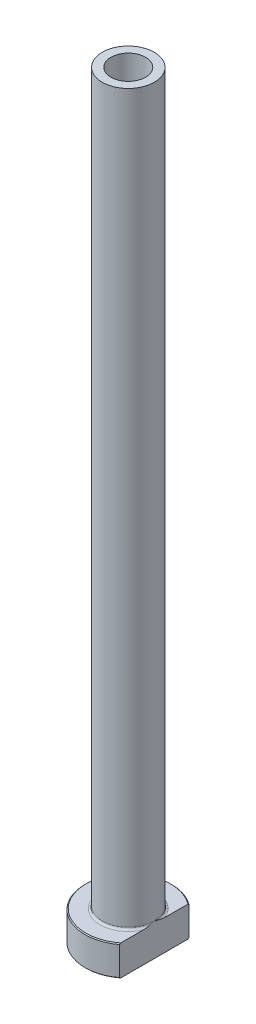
from build123d import *

# Parameters (mm, degrees)
FILLET1_R          = 0.5
CHAMFER1_SIZE      = 0.2
CUT_EXTRUDE1_DEPTH = 176.570498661
CHAMFER2_SIZE      = 0.5


with BuildPart() as part:
    # Sketch1 → Revolve1 (revolve)
    with BuildSketch(Plane.XY, mode=Mode.PRIVATE) as revolve1_sk:
        Polygon((-4, 175), (-6, 175), (-6, 7), (-10, 7), (-10, 0), (-4.25, 0), (-4.25, 118), (-4, 130), align=None)
    revolve(revolve1_sk.sketch.rotate(Axis((0, 92.187680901, 0), (0, -1, 0)), 270), axis=Axis((0, 92.187680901, 0), (0, -1, 0)))

    # Fillet1
    fillet1_edges = [part.edges().sort_by_distance(p)[0] for p in [
        (0, 7, -6),
    ]]
    fillet(fillet1_edges, radius=FILLET1_R)

    # Chamfer1
    chamfer1_edges = [part.edges().sort_by_distance(p)[0] for p in [
        (0, 0, -10),
        (0, 7, -10),
    ]]
    chamfer(chamfer1_edges, length=CHAMFER1_SIZE)

    # Sketch2 → Cut-Extrude1 (cut, through all)
    with BuildSketch(Plane.XZ):
        with BuildLine():
            Line((6, 8), (6, -8))
            ThreePointArc((6, -8), (10, 0), (6, 8))
        make_face()
    extrude(amount=-CUT_EXTRUDE1_DEPTH, mode=Mode.SUBTRACT)

    # Chamfer2
    chamfer2_edges = [part.edges().sort_by_distance(p)[0] for p in [
        (0, 0, -4.25),
    ]]
    chamfer(chamfer2_edges, length=CHAMFER2_SIZE)


solid = part.part
